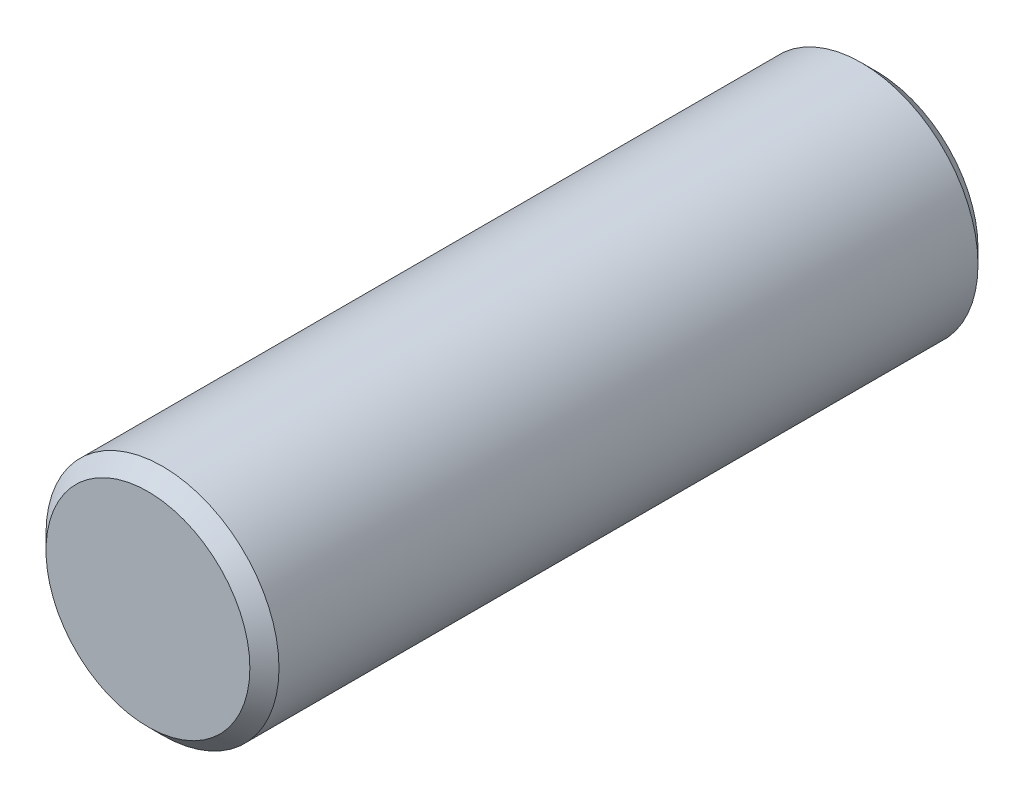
ISO-10303-21;
HEADER;
FILE_DESCRIPTION(('STEP AP214'),'2;1');
FILE_NAME('part.step','',(''),(''),'','','');
FILE_SCHEMA(('AUTOMOTIVE_DESIGN { 1 0 10303 214 1 1 1 1 }'));
ENDSEC;
DATA;
#1=APPLICATION_CONTEXT('core data for automotive mechanical design processes');
#2=APPLICATION_PROTOCOL_DEFINITION('international standard','automotive_design',2000,#1);
#3=PRODUCT_CONTEXT('',#1,'mechanical');
#4=PRODUCT('Part','Part','',(#3));
#5=PRODUCT_RELATED_PRODUCT_CATEGORY('part','',(#4));
#6=PRODUCT_DEFINITION_FORMATION('','',#4);
#7=PRODUCT_DEFINITION_CONTEXT('part definition',#1,'design');
#8=PRODUCT_DEFINITION('design','',#6,#7);
#9=PRODUCT_DEFINITION_SHAPE('','',#8);
#10=(LENGTH_UNIT() NAMED_UNIT(*) SI_UNIT(.MILLI.,.METRE.));
#11=(NAMED_UNIT(*) PLANE_ANGLE_UNIT() SI_UNIT($,.RADIAN.));
#12=(NAMED_UNIT(*) SI_UNIT($,.STERADIAN.) SOLID_ANGLE_UNIT());
#13=UNCERTAINTY_MEASURE_WITH_UNIT(LENGTH_MEASURE(1.E-05),#10,'distance_accuracy_value','');
#14=(GEOMETRIC_REPRESENTATION_CONTEXT(3) GLOBAL_UNCERTAINTY_ASSIGNED_CONTEXT((#13)) GLOBAL_UNIT_ASSIGNED_CONTEXT((#10,
#11,#12)) REPRESENTATION_CONTEXT('',''));
#15=CARTESIAN_POINT('',(0.,0.,0.));
#16=DIRECTION('',(0.,0.,1.));
#17=DIRECTION('',(1.,0.,0.));
#18=AXIS2_PLACEMENT_3D('',#15,#16,#17);
#19=CARTESIAN_POINT('',(0.,0.,50.));
#20=DIRECTION('',(0.,0.,-1.));
#21=DIRECTION('',(-1.,0.,0.));
#22=AXIS2_PLACEMENT_3D('',#19,#20,#21);
#23=CYLINDRICAL_SURFACE('',#22,8.);
#24=CARTESIAN_POINT('',(0.,0.,0.999999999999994));
#25=DIRECTION('',(0.,0.,1.));
#26=DIRECTION('',(1.,0.,0.));
#27=AXIS2_PLACEMENT_3D('',#24,#25,#26);
#28=CIRCLE('',#27,8.);
#29=CARTESIAN_POINT('',(8.,0.,0.999999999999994));
#30=VERTEX_POINT('',#29);
#31=EDGE_CURVE('E41',#30,#30,#28,.T.);
#32=ORIENTED_EDGE('',*,*,#31,.T.);
#33=EDGE_LOOP('',(#32));
#34=FACE_BOUND('',#33,.T.);
#35=CARTESIAN_POINT('',(0.,0.,49.));
#36=DIRECTION('',(0.,0.,1.));
#37=DIRECTION('',(1.,0.,0.));
#38=AXIS2_PLACEMENT_3D('',#35,#36,#37);
#39=CIRCLE('',#38,8.);
#40=CARTESIAN_POINT('',(8.,0.,49.));
#41=VERTEX_POINT('',#40);
#42=EDGE_CURVE('E45',#41,#41,#39,.F.);
#43=ORIENTED_EDGE('',*,*,#42,.T.);
#44=EDGE_LOOP('',(#43));
#45=FACE_BOUND('',#44,.T.);
#46=ADVANCED_FACE('F30',(#34,#45),#23,.T.);
#47=CARTESIAN_POINT('',(0.,0.,50.));
#48=DIRECTION('',(0.,0.,1.));
#49=DIRECTION('',(1.,0.,0.));
#50=AXIS2_PLACEMENT_3D('',#47,#48,#49);
#51=PLANE('',#50);
#52=CARTESIAN_POINT('',(0.,0.,50.));
#53=DIRECTION('',(0.,0.,1.));
#54=DIRECTION('',(1.,0.,0.));
#55=AXIS2_PLACEMENT_3D('',#52,#53,#54);
#56=CIRCLE('',#55,7.00000000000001);
#57=CARTESIAN_POINT('',(7.00000000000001,0.,50.));
#58=VERTEX_POINT('',#57);
#59=EDGE_CURVE('E10',#58,#58,#56,.T.);
#60=ORIENTED_EDGE('',*,*,#59,.T.);
#61=EDGE_LOOP('',(#60));
#62=FACE_BOUND('',#61,.T.);
#63=ADVANCED_FACE('F61',(#62),#51,.T.);
#64=CARTESIAN_POINT('',(0.,0.,0.));
#65=DIRECTION('',(0.,0.,1.));
#66=DIRECTION('',(1.,0.,0.));
#67=AXIS2_PLACEMENT_3D('',#64,#65,#66);
#68=PLANE('',#67);
#69=CARTESIAN_POINT('',(0.,0.,0.));
#70=DIRECTION('',(0.,0.,1.));
#71=DIRECTION('',(1.,0.,0.));
#72=AXIS2_PLACEMENT_3D('',#69,#70,#71);
#73=CIRCLE('',#72,7.);
#74=CARTESIAN_POINT('',(7.,0.,0.));
#75=VERTEX_POINT('',#74);
#76=EDGE_CURVE('E37',#75,#75,#73,.F.);
#77=ORIENTED_EDGE('',*,*,#76,.T.);
#78=EDGE_LOOP('',(#77));
#79=FACE_BOUND('',#78,.T.);
#80=ADVANCED_FACE('F58',(#79),#68,.F.);
#81=CARTESIAN_POINT('',(0.,0.,0.999999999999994));
#82=DIRECTION('',(0.,0.,1.));
#83=DIRECTION('',(1.,0.,0.));
#84=AXIS2_PLACEMENT_3D('',#81,#82,#83);
#85=CONICAL_SURFACE('',#84,8.,0.785398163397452);
#86=ORIENTED_EDGE('',*,*,#76,.F.);
#87=EDGE_LOOP('',(#86));
#88=FACE_BOUND('',#87,.T.);
#89=ORIENTED_EDGE('',*,*,#31,.F.);
#90=EDGE_LOOP('',(#89));
#91=FACE_BOUND('',#90,.T.);
#92=ADVANCED_FACE('F54',(#88,#91),#85,.T.);
#93=CARTESIAN_POINT('',(0.,0.,50.));
#94=DIRECTION('',(0.,0.,-1.));
#95=DIRECTION('',(-1.,0.,0.));
#96=AXIS2_PLACEMENT_3D('',#93,#94,#95);
#97=CONICAL_SURFACE('',#96,7.00000000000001,0.785398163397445);
#98=ORIENTED_EDGE('',*,*,#42,.F.);
#99=EDGE_LOOP('',(#98));
#100=FACE_BOUND('',#99,.T.);
#101=ORIENTED_EDGE('',*,*,#59,.F.);
#102=EDGE_LOOP('',(#101));
#103=FACE_BOUND('',#102,.T.);
#104=ADVANCED_FACE('F32',(#100,#103),#97,.T.);
#105=CLOSED_SHELL('',(#46,#63,#80,#92,#104));
#106=MANIFOLD_SOLID_BREP('B2',#105);
#107=ADVANCED_BREP_SHAPE_REPRESENTATION('',(#18,#106),#14);
#108=SHAPE_DEFINITION_REPRESENTATION(#9,#107);
ENDSEC;
END-ISO-10303-21;
